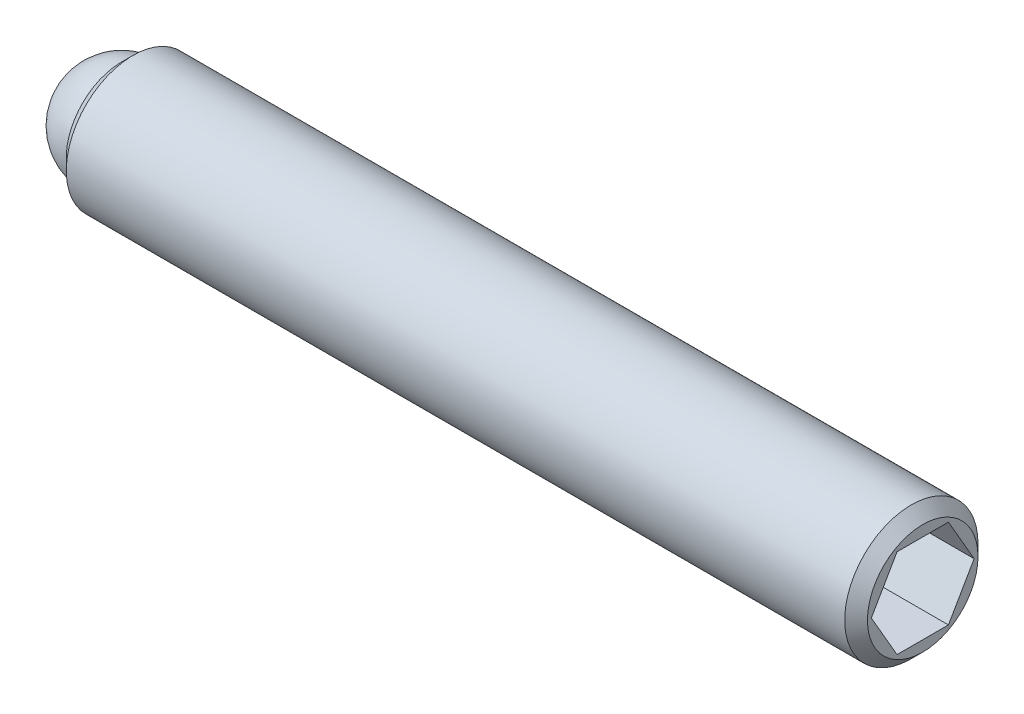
from build123d import *

# Parameters (mm, degrees)
SKETCH2_R           = 1.4859
BOSS_EXTRUDE1_DEPTH = 17.859375
CHAMFER1_SIZE       = 0.254
CHAMFER2_SIZE       = 0.254
CUT_EXTRUDE2_DEPTH  = 2.286
SKETCH3_R           = 1.190625
CUT_EXTRUDE3_DEPTH  = 1.190625


with BuildPart() as part:
    # Sketch2 → Boss-Extrude1 (new body)
    with BuildSketch(Plane(origin=(0, 0, 0), x_dir=(0, 0, -1), z_dir=(1, 0, 0))):
        Circle(SKETCH2_R)
    extrude(amount=BOSS_EXTRUDE1_DEPTH)

    # Chamfer1
    chamfer1_edges = [part.edges().sort_by_distance(p)[0] for p in [
        (0, 0, 1.4859),
    ]]
    chamfer(chamfer1_edges, length=CHAMFER1_SIZE)

    # Chamfer2
    chamfer2_edges = [part.edges().sort_by_distance(p)[0] for p in [
        (17.859375, 0, 1.4859),
    ]]
    chamfer(chamfer2_edges, length=CHAMFER2_SIZE)

    # Sketch4 → Cut-Extrude2 (cut)
    with BuildSketch(Plane(origin=(17.859375, 0, 0), x_dir=(0, 0, -1), z_dir=(1, 0, 0))):
        Polygon((1.14567944, 0), (0.57283972, 0.9921875), (-0.57283972, 0.9921875), (-1.14567944, 0), (-0.57283972, -0.9921875), (0.57283972, -0.9921875), align=None)
    extrude(amount=-CUT_EXTRUDE2_DEPTH, mode=Mode.SUBTRACT)

    # Sketch3 → Cut-Extrude3 (cut)
    with BuildSketch(Plane.ZY):
        Circle(SKETCH3_R)
    extrude(amount=-CUT_EXTRUDE3_DEPTH, mode=Mode.SUBTRACT)


with BuildPart() as body_2:
    # Sketch5 → Revolve1 (revolve)
    with BuildSketch(Plane.ZY):
        with BuildLine():
            Line((0, 0), (0, -1.190625))
            ThreePointArc((0, -1.190625), (-1.190625, 0), (0, 1.190625))
            Line((0, 1.190625), (0, 0))
        make_face()
    revolve(axis=Axis((0, 0, 0), (0, 1, 0)))


solid = Compound([part.part, body_2.part])
